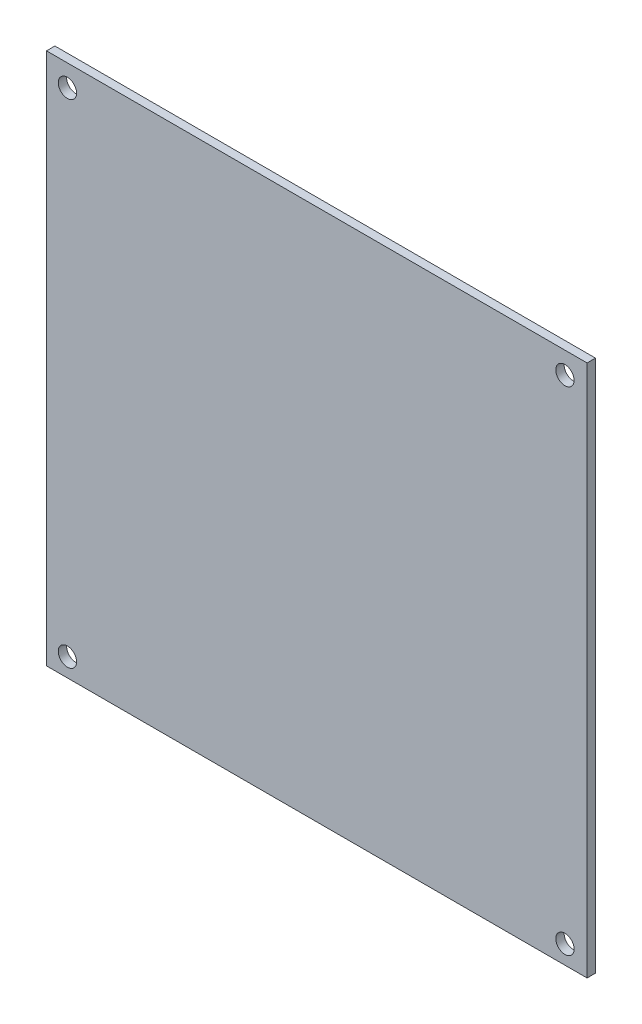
from build123d import *

# Parameters (mm, degrees)
SKETCH1_W           = 228.6
SKETCH1_H           = 101.6
EXTRUDE1_DEPTH      = 1.6
SKETCH3_R           = 1.875
EXTRUDE3_DEPTH      = 251.166104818
SKETCH4_OUTSIDE_W   = 280.634
SKETCH4_OUTSIDE_H   = 153.634
SKETCH4_OUTSIDE_W_2 = 103.106499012
SKETCH4_OUTSIDE_H_2 = 109.110692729
CUT_EXTRUDE1_DEPTH  = 251.166104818
SKETCH5_R           = 1.75
CUT_EXTRUDE2_DEPTH  = 222.848589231


with BuildPart() as part:
    # Sketch1 → Extrude1 (new body)
    with BuildSketch(Plane.XY):
        with Locations((114.3, 50.8)):
            Rectangle(SKETCH1_W, SKETCH1_H)
    extrude(amount=EXTRUDE1_DEPTH)

    # Sketch3 → Extrude3 (cut, through all)
    with BuildSketch(Plane.XY.offset(1.6)):
        with Locations((3.75, 97.85)):
            Circle(SKETCH3_R)
        with Locations((224.85, 97.85)):
            Circle(SKETCH3_R)
        with Locations((224.85, 3.75)):
            Circle(SKETCH3_R)
        with Locations((3.75, 3.75)):
            Circle(SKETCH3_R)
    extrude(amount=-EXTRUDE3_DEPTH, mode=Mode.SUBTRACT)

    # Sketch4 outside → Cut-Extrude1 (cut, through all)
    with BuildSketch(Plane.XY.offset(1.6)):
        with Locations((114.3, 50.8)):
            Rectangle(SKETCH4_OUTSIDE_W, SKETCH4_OUTSIDE_H)
        with Locations((145.656477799, 52.766891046)):
            Rectangle(SKETCH4_OUTSIDE_W_2, SKETCH4_OUTSIDE_H_2, mode=Mode.SUBTRACT)
    extrude(amount=-CUT_EXTRUDE1_DEPTH, mode=Mode.SUBTRACT)

    # Sketch5 → Cut-Extrude2 (cut, through all)
    with BuildSketch(Plane.XY.offset(1.6)):
        with Locations((98.087288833, 97.476150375)):
            Circle(SKETCH5_R)
        with Locations((192.987523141, 97.476150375)):
            Circle(SKETCH5_R)
        with Locations((192.987523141, 3.528490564)):
            Circle(SKETCH5_R)
        with Locations((98.087288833, 3.528490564)):
            Circle(SKETCH5_R)
    extrude(amount=-CUT_EXTRUDE2_DEPTH, mode=Mode.SUBTRACT)


solid = part.part
